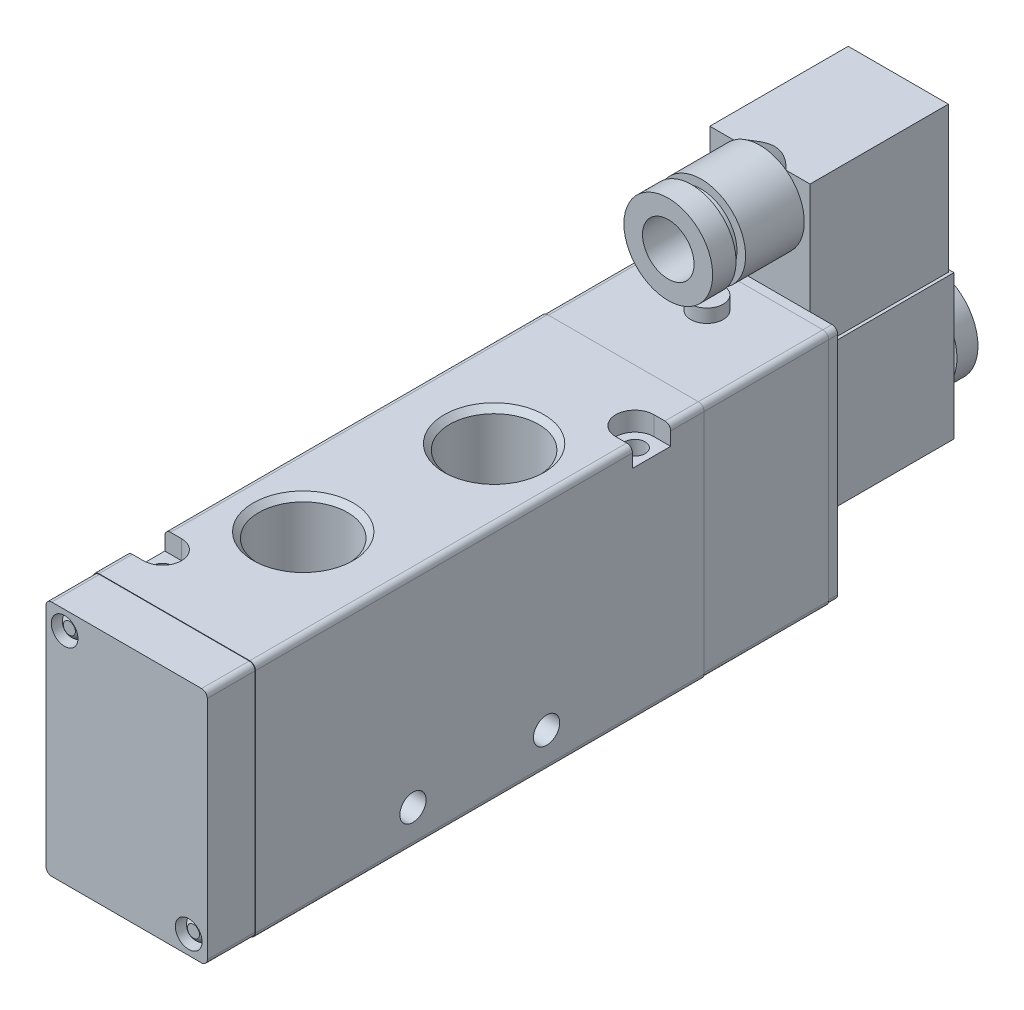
from build123d import *

# Parameters (mm, degrees)
EXTRUDE_1_DEPTH          = 94
CUT_EXTRUDE_1_DEPTH      = 25
CUT_EXTRUDE_1_DEPTH_BACK = 25
SKETCH_2_R               = 2.15
CUT_EXTRUDE_2_DEPTH      = 25
CUT_EXTRUDE_2_DEPTH_BACK = 25
SKETCH_3_R               = 2.15
CUT_EXTRUDE_3_DEPTH      = 4
CUT_EXTRUDE_4_DEPTH      = 4
CUT_EXTRUDE_5_DEPTH      = 17
CUT_EXTRUDE_5_DEPTH_BACK = 17
SKETCH_8_R               = 2.75
CUT_EXTRUDE_6_DEPTH      = 17
CUT_EXTRUDE_6_DEPTH_BACK = 17
SKETCH_9_R               = 2.75
EXTRUDE_2_DEPTH          = 10
EXTRUDE_START            = -26.2
EXTRUDE_3_DEPTH          = 26.2
SKETCH_17_W              = 3.4
SKETCH_17_H              = 2.8
EXTRUDE_4_DEPTH          = 28.2
EXTRUDE_5_DEPTH          = 11.15
EXTRUDE_5_DEPTH_BACK     = 11.15
SKETCH_19_W              = 30
SKETCH_19_H              = 30.2
SKETCH_21_W              = 21
SKETCH_21_H              = 29
EXTRUDE_6_DEPTH          = 47.5


with BuildPart() as part:
    # Sketch 1 → Extrude 1 (new body)
    with BuildSketch(Plane.XY):
        with BuildLine():
            Line((-17, 23.8), (-17, -23.8))
            ThreePointArc((-17, -23.8), (-16.648528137, -24.648528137), (-15.8, -25))
            Line((-15.8, -25), (15.8, -25))
            ThreePointArc((15.8, -25), (16.648528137, -24.648528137), (17, -23.8))
            Line((17, -23.8), (17, 23.8))
            ThreePointArc((17, 23.8), (16.648528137, 24.648528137), (15.8, 25))
            Line((15.8, 25), (-15.8, 25))
            ThreePointArc((-15.8, 25), (-16.648528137, 24.648528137), (-17, 23.8))
        make_face()
    extrude(amount=-EXTRUDE_1_DEPTH)

    # Sketch 2 → Cut-Extrude 1 (cut, two sides: drawn at the far end of the back side and taken through both)
    with BuildSketch(Plane(origin=(0, 0, 0), x_dir=(1, 0, 0), z_dir=(0, 1, 0)).offset(-CUT_EXTRUDE_1_DEPTH_BACK)):
        with Locations(Location((-13.5, 11, 0), (0, 0, 270))):
            Circle(SKETCH_2_R)
    extrude(amount=CUT_EXTRUDE_1_DEPTH + CUT_EXTRUDE_1_DEPTH_BACK, mode=Mode.SUBTRACT)

    # Sketch 3 → Cut-Extrude 2 (cut, two sides: drawn at the far end of the back side and taken through both)
    with BuildSketch(Plane(origin=(0, 0, 0), x_dir=(1, 0, 0), z_dir=(0, 1, 0)).offset(-CUT_EXTRUDE_2_DEPTH_BACK)):
        with Locations(Location((13.5, 83, 0), (0, 0, 270))):
            Circle(SKETCH_3_R)
    extrude(amount=CUT_EXTRUDE_2_DEPTH + CUT_EXTRUDE_2_DEPTH_BACK, mode=Mode.SUBTRACT)

    # Sketch 4 → Cut-Extrude 3 (cut)
    with BuildSketch(Plane(origin=(0, 25, 0), x_dir=(1, 0, 0), z_dir=(0, 1, 0))):
        with BuildLine():
            Line((-17, 15), (-17, 7))
            Line((-17, 7), (-13.5, 7))
            ThreePointArc((-13.5, 7), (-9.5, 11), (-13.5, 15))
            Line((-13.5, 15), (-17, 15))
        make_face()
    extrude(amount=-CUT_EXTRUDE_3_DEPTH, mode=Mode.SUBTRACT)

    # Sketch 5 → Cut-Extrude 4 (cut)
    with BuildSketch(Plane(origin=(0, 25, 0), x_dir=(1, 0, 0), z_dir=(0, 1, 0))):
        with BuildLine():
            Line((13.5, 79), (17, 79))
            Line((17, 79), (17, 87))
            Line((17, 87), (13.5, 87))
            ThreePointArc((13.5, 87), (9.5, 83), (13.5, 79))
        make_face()
    extrude(amount=-CUT_EXTRUDE_4_DEPTH, mode=Mode.SUBTRACT)

    # Sketch 6 → Cut-Revolve 1 (revolve, cut)
    with BuildSketch(Plane.XY.offset(-29), mode=Mode.PRIVATE) as cut_revolve_1_sk:
        Polygon((-2, 8.333333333), (-11.3155, 8.333333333), (-11.3155, 23.838), (-12.4775, 25), (-2, 25), align=None)
    revolve(cut_revolve_1_sk.sketch.rotate(Axis((-2, 25, -29), (0, -1, 0)), 90), axis=Axis((-2, 25, -29), (0, -1, 0)), mode=Mode.SUBTRACT)

    # Sketch 7 → Cut-Revolve 2 (revolve, cut)
    with BuildSketch(Plane.XY.offset(-65), mode=Mode.PRIVATE) as cut_revolve_2_sk:
        Polygon((2, 25), (12.4775, 25), (11.3155, 23.838), (11.3155, 8.333333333), (2, 8.333333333), align=None)
    revolve(cut_revolve_2_sk.sketch.rotate(Axis((2, 8.333333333, -65), (0, 1, 0)), 270), axis=Axis((2, 8.333333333, -65), (0, 1, 0)), mode=Mode.SUBTRACT)

    # Sketch 8 → Cut-Extrude 5 (cut, two sides: drawn at the far end of the back side and taken through both)
    with BuildSketch(Plane(origin=(0, 0, 0), x_dir=(0, 0, -1), z_dir=(1, 0, 0)).offset(-CUT_EXTRUDE_5_DEPTH_BACK)):
        with Locations((33, -17.5)):
            Circle(SKETCH_8_R)
    extrude(amount=CUT_EXTRUDE_5_DEPTH + CUT_EXTRUDE_5_DEPTH_BACK, mode=Mode.SUBTRACT)

    # Sketch 9 → Cut-Extrude 6 (cut, two sides: drawn at the far end of the back side and taken through both)
    with BuildSketch(Plane(origin=(0, 0, 0), x_dir=(0, 0, -1), z_dir=(1, 0, 0)).offset(-CUT_EXTRUDE_6_DEPTH_BACK)):
        with Locations((61, -17.5)):
            Circle(SKETCH_9_R)
    extrude(amount=CUT_EXTRUDE_6_DEPTH + CUT_EXTRUDE_6_DEPTH_BACK, mode=Mode.SUBTRACT)

    # Sketch 10 → Cut-Revolve 3 (revolve, cut)
    with BuildSketch(Plane(origin=(0, 0, 0), x_dir=(0, 0, -1), z_dir=(1, 0, 0)), mode=Mode.PRIVATE) as cut_revolve_3_sk:
        Polygon((15.5, -8.333333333), (24.8155, -8.333333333), (24.8155, -23.838), (25.9775, -25), (15.5, -25), align=None)
    revolve(cut_revolve_3_sk.sketch.rotate(Axis((0, -25, -15.5), (0, 1, 0)), 180), axis=Axis((0, -25, -15.5), (0, 1, 0)), mode=Mode.SUBTRACT)

    # Sketch 11 → Cut-Revolve 4 (revolve, cut)
    with BuildSketch(Plane(origin=(0, 0, 0), x_dir=(0, 0, -1), z_dir=(1, 0, 0)), mode=Mode.PRIVATE) as cut_revolve_4_sk:
        Polygon((47, -25), (36.5225, -25), (37.6845, -23.838), (37.6845, -8.333333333), (47, -8.333333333), align=None)
    revolve(cut_revolve_4_sk.sketch.rotate(Axis((0, -8.333333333, -47), (0, -1, 0)), 180), axis=Axis((0, -8.333333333, -47), (0, -1, 0)), mode=Mode.SUBTRACT)

    # Sketch 12 → Cut-Revolve 5 (revolve, cut)
    with BuildSketch(Plane(origin=(0, 0, 0), x_dir=(0, 0, -1), z_dir=(1, 0, 0)), mode=Mode.PRIVATE) as cut_revolve_5_sk:
        Polygon((78.5, -25), (68.0225, -25), (69.1845, -23.838), (69.1845, -8.333333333), (78.5, -8.333333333), align=None)
    revolve(cut_revolve_5_sk.sketch.rotate(Axis((0, -8.333333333, -78.5), (0, -1, 0)), 180), axis=Axis((0, -8.333333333, -78.5), (0, -1, 0)), mode=Mode.SUBTRACT)

    # Sketch 13 → Extrude 2 (add)
    with BuildSketch(Plane.XY):
        with BuildLine():
            Line((-16.9, 23.7), (-16.9, -23.7))
            ThreePointArc((-16.9, -23.7), (-16.548528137, -24.548528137), (-15.7, -24.9))
            Line((-15.7, -24.9), (15.7, -24.9))
            ThreePointArc((15.7, -24.9), (16.548528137, -24.548528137), (16.9, -23.7))
            Line((16.9, -23.7), (16.9, 23.7))
            ThreePointArc((16.9, 23.7), (16.548528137, 24.548528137), (15.7, 24.9))
            Line((15.7, 24.9), (-15.7, 24.9))
            ThreePointArc((-15.7, 24.9), (-16.548528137, 24.548528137), (-16.9, 23.7))
        make_face()
    extrude(amount=EXTRUDE_2_DEPTH)

    # Sketch 14 → Cut-Revolve 6 (revolve, cut)
    with BuildSketch(Plane(origin=(-13, 0, 0), x_dir=(0, 0, -1), z_dir=(1, 0, 0)), mode=Mode.PRIVATE) as cut_revolve_6_sk:
        with BuildLine():
            Line((-10, 21), (-10, 23.8))
            Line((-10, 23.8), (-6.5, 23.8))
            ThreePointArc((-6.5, 23.8), (-7.967878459, 23.384393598), (-9, 22.260952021))
            Line((-9, 22.260952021), (-9, 21))
            Line((-9, 21), (-10, 21))
        make_face()
    revolve(cut_revolve_6_sk.sketch.rotate(Axis((-13, 21, 6.5), (0, 0, 1)), 180), axis=Axis((-13, 21, 6.5), (0, 0, 1)), mode=Mode.SUBTRACT)

    # Sketch 15 → Cut-Revolve 7 (revolve, cut)
    with BuildSketch(Plane(origin=(13, 0, 0), x_dir=(0, 0, -1), z_dir=(1, 0, 0)), mode=Mode.PRIVATE) as cut_revolve_7_sk:
        with BuildLine():
            Line((-10, -21), (-10, -18.2))
            Line((-10, -18.2), (-6.5, -18.2))
            ThreePointArc((-6.5, -18.2), (-7.967878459, -18.615606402), (-9, -19.739047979))
            Line((-9, -19.739047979), (-9, -21))
            Line((-9, -21), (-10, -21))
        make_face()
    revolve(cut_revolve_7_sk.sketch.rotate(Axis((13, -21, 6.5), (0, 0, 1)), 180), axis=Axis((13, -21, 6.5), (0, 0, 1)), mode=Mode.SUBTRACT)

    # Sketch 16 → Extrude 3 (add)
    with BuildSketch(Plane.XY.offset(-94).offset(EXTRUDE_START)):
        with BuildLine():
            Line((-16.9, 23.7), (-16.9, -23.7))
            ThreePointArc((-16.9, -23.7), (-16.548528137, -24.548528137), (-15.7, -24.9))
            Line((-15.7, -24.9), (15.7, -24.9))
            ThreePointArc((15.7, -24.9), (16.548528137, -24.548528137), (16.9, -23.7))
            Line((16.9, -23.7), (16.9, 23.7))
            ThreePointArc((16.9, 23.7), (16.548528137, 24.548528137), (15.7, 24.9))
            Line((15.7, 24.9), (-15.7, 24.9))
            ThreePointArc((-15.7, 24.9), (-16.548528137, 24.548528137), (-16.9, 23.7))
        make_face()
    extrude(amount=EXTRUDE_3_DEPTH)

    # Sketch 17 → Revolve 1 (revolve)
    with BuildSketch(Plane(origin=(0, 0, 0), x_dir=(0, 0, -1), z_dir=(1, 0, 0)), mode=Mode.PRIVATE) as revolve_1_sk:
        with Locations((113.3, 26.3)):
            Rectangle(SKETCH_17_W, SKETCH_17_H)
    revolve(revolve_1_sk.sketch.rotate(Axis((0, 24.9, -111.6), (0, 1, 0)), 180), axis=Axis((0, 24.9, -111.6), (0, 1, 0)))

    # Sketch 18 → Extrude 4 (add)
    with BuildSketch(Plane.XY.offset(-94)):
        with BuildLine():
            Line((-16.8, 23.6), (-16.8, -23.6))
            ThreePointArc((-16.8, -23.6), (-16.448528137, -24.448528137), (-15.6, -24.8))
            Line((-15.6, -24.8), (15.6, -24.8))
            ThreePointArc((15.6, -24.8), (16.448528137, -24.448528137), (16.8, -23.6))
            Line((16.8, -23.6), (16.8, 23.6))
            ThreePointArc((16.8, 23.6), (16.448528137, 24.448528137), (15.6, 24.8))
            Line((15.6, 24.8), (-15.6, 24.8))
            ThreePointArc((-15.6, 24.8), (-16.448528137, 24.448528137), (-16.8, 23.6))
        make_face()
    extrude(amount=-EXTRUDE_4_DEPTH)

    # Sketch 19 → Extrude 5 (add, two sides: drawn at the far end of the back side and taken through both)
    with BuildSketch(Plane(origin=(0, 0, 0), x_dir=(0, 0, -1), z_dir=(1, 0, 0)).offset(-EXTRUDE_5_DEPTH_BACK)):
        with Locations((137.2, 1.9)):
            Rectangle(SKETCH_19_W, SKETCH_19_H)
    extrude(amount=EXTRUDE_5_DEPTH + EXTRUDE_5_DEPTH_BACK)

    # Sketch 20 → Revolve 2 (revolve)
    with BuildSketch(Plane(origin=(0, 0, 0), x_dir=(0, 0, -1), z_dir=(1, 0, 0)), mode=Mode.PRIVATE) as revolve_2_sk:
        Polygon((152.2, 0), (152.2, 10), (153, 10), (153, 7.5), (154, 7.5), (154, 10), (158.4, 10), (158.4, 0), align=None)
    revolve(revolve_2_sk.sketch.rotate(Axis((0, 0, -158.4), (0, 0, 1)), 270), axis=Axis((0, 0, -158.4), (0, 0, 1)))

    # Sketch 21 → Extrude 6 (add)
    with BuildSketch(Plane(origin=(0, 0, 0), x_dir=(1, 0, 0), z_dir=(0, 1, 0))):
        with Locations((0, 137.2)):
            Rectangle(SKETCH_21_W, SKETCH_21_H)
    extrude(amount=EXTRUDE_6_DEPTH)

    # Sketch 22 → Revolve 3 (revolve)
    with BuildSketch(Plane(origin=(0, 0, 0), x_dir=(0, 0, -1), z_dir=(1, 0, 0)), mode=Mode.PRIVATE) as revolve_3_sk:
        Polygon((138.80807251, 40), (122.7, 30.7), (110.4, 30.7), (110.4, 32.5), (108.4, 32.5), (108.4, 30.7), (103.5, 30.7), (103.5, 34.6), (122.7, 34.6), (122.7, 40), align=None)
    revolve(revolve_3_sk.sketch.rotate(Axis((0, 40, -103.5), (0, 0, -1)), 90), axis=Axis((0, 40, -103.5), (0, 0, -1)))


solid = part.part
